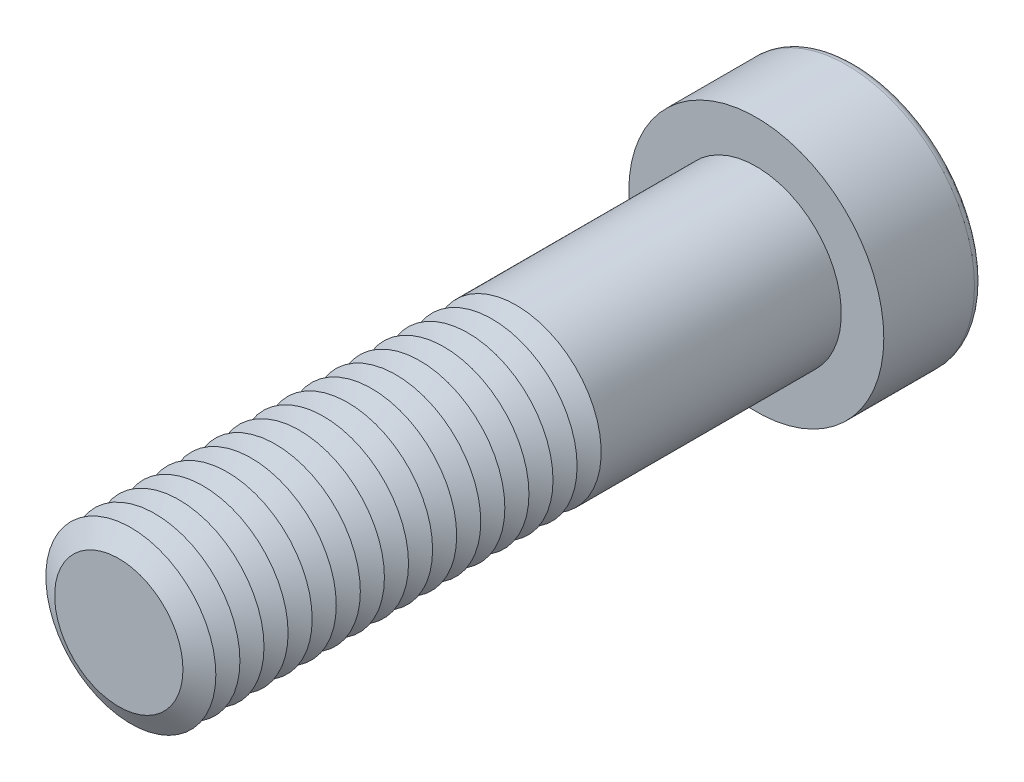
ISO-10303-21;
HEADER;
FILE_DESCRIPTION(('STEP AP214'),'2;1');
FILE_NAME('part.step','',(''),(''),'','','');
FILE_SCHEMA(('AUTOMOTIVE_DESIGN { 1 0 10303 214 1 1 1 1 }'));
ENDSEC;
DATA;
#1=APPLICATION_CONTEXT('core data for automotive mechanical design processes');
#2=APPLICATION_PROTOCOL_DEFINITION('international standard','automotive_design',2000,#1);
#3=PRODUCT_CONTEXT('',#1,'mechanical');
#4=PRODUCT('Part','Part','',(#3));
#5=PRODUCT_RELATED_PRODUCT_CATEGORY('part','',(#4));
#6=PRODUCT_DEFINITION_FORMATION('','',#4);
#7=PRODUCT_DEFINITION_CONTEXT('part definition',#1,'design');
#8=PRODUCT_DEFINITION('design','',#6,#7);
#9=PRODUCT_DEFINITION_SHAPE('','',#8);
#10=(LENGTH_UNIT() NAMED_UNIT(*) SI_UNIT(.MILLI.,.METRE.));
#11=(NAMED_UNIT(*) PLANE_ANGLE_UNIT() SI_UNIT($,.RADIAN.));
#12=(NAMED_UNIT(*) SI_UNIT($,.STERADIAN.) SOLID_ANGLE_UNIT());
#13=UNCERTAINTY_MEASURE_WITH_UNIT(LENGTH_MEASURE(1.E-05),#10,'distance_accuracy_value','');
#14=(GEOMETRIC_REPRESENTATION_CONTEXT(3) GLOBAL_UNCERTAINTY_ASSIGNED_CONTEXT((#13)) GLOBAL_UNIT_ASSIGNED_CONTEXT((#10,
#11,#12)) REPRESENTATION_CONTEXT('',''));
#15=CARTESIAN_POINT('',(0.,0.,0.));
#16=DIRECTION('',(0.,0.,1.));
#17=DIRECTION('',(1.,0.,0.));
#18=AXIS2_PLACEMENT_3D('',#15,#16,#17);
#19=CARTESIAN_POINT('',(0.,0.,39.05));
#20=DIRECTION('',(0.,0.,1.));
#21=DIRECTION('',(1.,0.,0.));
#22=AXIS2_PLACEMENT_3D('',#19,#20,#21);
#23=CONICAL_SURFACE('',#22,6.,1.0471975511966);
#24=CARTESIAN_POINT('',(0.,0.,38.2));
#25=DIRECTION('',(0.,0.,1.));
#26=DIRECTION('',(1.,0.,0.));
#27=AXIS2_PLACEMENT_3D('',#24,#25,#26);
#28=CIRCLE('',#27,4.52775681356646);
#29=CARTESIAN_POINT('',(4.52775681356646,0.,38.2));
#30=VERTEX_POINT('',#29);
#31=EDGE_CURVE('E312',#30,#30,#28,.T.);
#32=ORIENTED_EDGE('',*,*,#31,.T.);
#33=EDGE_LOOP('',(#32));
#34=FACE_BOUND('',#33,.T.);
#35=CARTESIAN_POINT('',(0.,0.,39.05));
#36=DIRECTION('',(0.,0.,1.));
#37=DIRECTION('',(1.,0.,0.));
#38=AXIS2_PLACEMENT_3D('',#35,#36,#37);
#39=CIRCLE('',#38,6.);
#40=CARTESIAN_POINT('',(6.,0.,39.05));
#41=VERTEX_POINT('',#40);
#42=EDGE_CURVE('E315',#41,#41,#39,.T.);
#43=ORIENTED_EDGE('',*,*,#42,.F.);
#44=EDGE_LOOP('',(#43));
#45=FACE_BOUND('',#44,.T.);
#46=ADVANCED_FACE('F39',(#34,#45),#23,.T.);
#47=CARTESIAN_POINT('',(0.,0.,38.2));
#48=DIRECTION('',(0.,0.,-1.));
#49=DIRECTION('',(-1.,0.,0.));
#50=AXIS2_PLACEMENT_3D('',#47,#48,#49);
#51=CONICAL_SURFACE('',#50,4.52775681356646,1.0471975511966);
#52=CARTESIAN_POINT('',(0.,0.,37.35));
#53=DIRECTION('',(0.,0.,1.));
#54=DIRECTION('',(1.,0.,0.));
#55=AXIS2_PLACEMENT_3D('',#52,#53,#54);
#56=CIRCLE('',#55,6.);
#57=CARTESIAN_POINT('',(6.,0.,37.35));
#58=VERTEX_POINT('',#57);
#59=EDGE_CURVE('E323',#58,#58,#56,.T.);
#60=ORIENTED_EDGE('',*,*,#59,.T.);
#61=EDGE_LOOP('',(#60));
#62=FACE_BOUND('',#61,.T.);
#63=ORIENTED_EDGE('',*,*,#31,.F.);
#64=EDGE_LOOP('',(#63));
#65=FACE_BOUND('',#64,.T.);
#66=ADVANCED_FACE('F244',(#62,#65),#51,.T.);
#67=CARTESIAN_POINT('',(0.,0.,45.));
#68=DIRECTION('',(0.,0.,1.));
#69=DIRECTION('',(1.,0.,0.));
#70=AXIS2_PLACEMENT_3D('',#67,#68,#69);
#71=PLANE('',#70);
#72=CARTESIAN_POINT('',(0.,0.,45.));
#73=DIRECTION('',(0.,0.,1.));
#74=DIRECTION('',(1.,0.,0.));
#75=AXIS2_PLACEMENT_3D('',#72,#73,#74);
#76=CIRCLE('',#75,4.52775681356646);
#77=CARTESIAN_POINT('',(4.52775681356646,0.,45.));
#78=VERTEX_POINT('',#77);
#79=EDGE_CURVE('E173',#78,#78,#76,.T.);
#80=ORIENTED_EDGE('',*,*,#79,.T.);
#81=EDGE_LOOP('',(#80));
#82=FACE_BOUND('',#81,.T.);
#83=ADVANCED_FACE('F250',(#82),#71,.T.);
#84=CARTESIAN_POINT('',(0.,0.,45.));
#85=DIRECTION('',(0.,0.,-1.));
#86=DIRECTION('',(-1.,0.,0.));
#87=AXIS2_PLACEMENT_3D('',#84,#85,#86);
#88=CONICAL_SURFACE('',#87,4.52775681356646,1.0471975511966);
#89=CARTESIAN_POINT('',(0.,0.,44.15));
#90=DIRECTION('',(0.,0.,1.));
#91=DIRECTION('',(1.,0.,0.));
#92=AXIS2_PLACEMENT_3D('',#89,#90,#91);
#93=CIRCLE('',#92,6.);
#94=CARTESIAN_POINT('',(6.,0.,44.15));
#95=VERTEX_POINT('',#94);
#96=EDGE_CURVE('E290',#95,#95,#93,.T.);
#97=ORIENTED_EDGE('',*,*,#96,.T.);
#98=EDGE_LOOP('',(#97));
#99=FACE_BOUND('',#98,.T.);
#100=ORIENTED_EDGE('',*,*,#79,.F.);
#101=EDGE_LOOP('',(#100));
#102=FACE_BOUND('',#101,.T.);
#103=ADVANCED_FACE('F198',(#99,#102),#88,.T.);
#104=CARTESIAN_POINT('',(0.,0.,44.15));
#105=DIRECTION('',(0.,0.,1.));
#106=DIRECTION('',(1.,0.,0.));
#107=AXIS2_PLACEMENT_3D('',#104,#105,#106);
#108=CONICAL_SURFACE('',#107,6.,1.0471975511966);
#109=CARTESIAN_POINT('',(0.,0.,43.3));
#110=DIRECTION('',(0.,0.,1.));
#111=DIRECTION('',(1.,0.,0.));
#112=AXIS2_PLACEMENT_3D('',#109,#110,#111);
#113=CIRCLE('',#112,4.52775681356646);
#114=CARTESIAN_POINT('',(4.52775681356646,0.,43.3));
#115=VERTEX_POINT('',#114);
#116=EDGE_CURVE('E287',#115,#115,#113,.T.);
#117=ORIENTED_EDGE('',*,*,#116,.T.);
#118=EDGE_LOOP('',(#117));
#119=FACE_BOUND('',#118,.T.);
#120=ORIENTED_EDGE('',*,*,#96,.F.);
#121=EDGE_LOOP('',(#120));
#122=FACE_BOUND('',#121,.T.);
#123=ADVANCED_FACE('F276',(#119,#122),#108,.T.);
#124=CARTESIAN_POINT('',(0.,0.,43.3));
#125=DIRECTION('',(0.,0.,-1.));
#126=DIRECTION('',(-1.,0.,0.));
#127=AXIS2_PLACEMENT_3D('',#124,#125,#126);
#128=CONICAL_SURFACE('',#127,4.52775681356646,1.0471975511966);
#129=CARTESIAN_POINT('',(0.,0.,42.45));
#130=DIRECTION('',(0.,0.,1.));
#131=DIRECTION('',(1.,0.,0.));
#132=AXIS2_PLACEMENT_3D('',#129,#130,#131);
#133=CIRCLE('',#132,6.);
#134=CARTESIAN_POINT('',(6.,0.,42.45));
#135=VERTEX_POINT('',#134);
#136=EDGE_CURVE('E299',#135,#135,#133,.T.);
#137=ORIENTED_EDGE('',*,*,#136,.T.);
#138=EDGE_LOOP('',(#137));
#139=FACE_BOUND('',#138,.T.);
#140=ORIENTED_EDGE('',*,*,#116,.F.);
#141=EDGE_LOOP('',(#140));
#142=FACE_BOUND('',#141,.T.);
#143=ADVANCED_FACE('F273',(#139,#142),#128,.T.);
#144=CARTESIAN_POINT('',(0.,0.,42.45));
#145=DIRECTION('',(0.,0.,1.));
#146=DIRECTION('',(1.,0.,0.));
#147=AXIS2_PLACEMENT_3D('',#144,#145,#146);
#148=CONICAL_SURFACE('',#147,6.,1.0471975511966);
#149=CARTESIAN_POINT('',(0.,0.,41.6));
#150=DIRECTION('',(0.,0.,1.));
#151=DIRECTION('',(1.,0.,0.));
#152=AXIS2_PLACEMENT_3D('',#149,#150,#151);
#153=CIRCLE('',#152,4.52775681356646);
#154=CARTESIAN_POINT('',(4.52775681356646,0.,41.6));
#155=VERTEX_POINT('',#154);
#156=EDGE_CURVE('E292',#155,#155,#153,.T.);
#157=ORIENTED_EDGE('',*,*,#156,.T.);
#158=EDGE_LOOP('',(#157));
#159=FACE_BOUND('',#158,.T.);
#160=ORIENTED_EDGE('',*,*,#136,.F.);
#161=EDGE_LOOP('',(#160));
#162=FACE_BOUND('',#161,.T.);
#163=ADVANCED_FACE('F269',(#159,#162),#148,.T.);
#164=CARTESIAN_POINT('',(0.,0.,41.6));
#165=DIRECTION('',(0.,0.,-1.));
#166=DIRECTION('',(-1.,0.,0.));
#167=AXIS2_PLACEMENT_3D('',#164,#165,#166);
#168=CONICAL_SURFACE('',#167,4.52775681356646,1.0471975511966);
#169=CARTESIAN_POINT('',(0.,0.,40.75));
#170=DIRECTION('',(0.,0.,1.));
#171=DIRECTION('',(1.,0.,0.));
#172=AXIS2_PLACEMENT_3D('',#169,#170,#171);
#173=CIRCLE('',#172,6.);
#174=CARTESIAN_POINT('',(6.,0.,40.75));
#175=VERTEX_POINT('',#174);
#176=EDGE_CURVE('E308',#175,#175,#173,.T.);
#177=ORIENTED_EDGE('',*,*,#176,.T.);
#178=EDGE_LOOP('',(#177));
#179=FACE_BOUND('',#178,.T.);
#180=ORIENTED_EDGE('',*,*,#156,.F.);
#181=EDGE_LOOP('',(#180));
#182=FACE_BOUND('',#181,.T.);
#183=ADVANCED_FACE('F265',(#179,#182),#168,.T.);
#184=CARTESIAN_POINT('',(0.,0.,40.75));
#185=DIRECTION('',(0.,0.,1.));
#186=DIRECTION('',(1.,0.,0.));
#187=AXIS2_PLACEMENT_3D('',#184,#185,#186);
#188=CONICAL_SURFACE('',#187,6.,1.0471975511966);
#189=CARTESIAN_POINT('',(0.,0.,39.9));
#190=DIRECTION('',(0.,0.,1.));
#191=DIRECTION('',(1.,0.,0.));
#192=AXIS2_PLACEMENT_3D('',#189,#190,#191);
#193=CIRCLE('',#192,4.52775681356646);
#194=CARTESIAN_POINT('',(4.52775681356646,0.,39.9));
#195=VERTEX_POINT('',#194);
#196=EDGE_CURVE('E305',#195,#195,#193,.T.);
#197=ORIENTED_EDGE('',*,*,#196,.T.);
#198=EDGE_LOOP('',(#197));
#199=FACE_BOUND('',#198,.T.);
#200=ORIENTED_EDGE('',*,*,#176,.F.);
#201=EDGE_LOOP('',(#200));
#202=FACE_BOUND('',#201,.T.);
#203=ADVANCED_FACE('F261',(#199,#202),#188,.T.);
#204=CARTESIAN_POINT('',(0.,0.,39.9));
#205=DIRECTION('',(0.,0.,-1.));
#206=DIRECTION('',(-1.,0.,0.));
#207=AXIS2_PLACEMENT_3D('',#204,#205,#206);
#208=CONICAL_SURFACE('',#207,4.52775681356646,1.0471975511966);
#209=ORIENTED_EDGE('',*,*,#42,.T.);
#210=EDGE_LOOP('',(#209));
#211=FACE_BOUND('',#210,.T.);
#212=ORIENTED_EDGE('',*,*,#196,.F.);
#213=EDGE_LOOP('',(#212));
#214=FACE_BOUND('',#213,.T.);
#215=ADVANCED_FACE('F257',(#211,#214),#208,.T.);
#216=CARTESIAN_POINT('',(0.,0.,37.35));
#217=DIRECTION('',(0.,0.,1.));
#218=DIRECTION('',(1.,0.,0.));
#219=AXIS2_PLACEMENT_3D('',#216,#217,#218);
#220=CONICAL_SURFACE('',#219,6.,1.0471975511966);
#221=CARTESIAN_POINT('',(0.,0.,36.5));
#222=DIRECTION('',(0.,0.,1.));
#223=DIRECTION('',(1.,0.,0.));
#224=AXIS2_PLACEMENT_3D('',#221,#222,#223);
#225=CIRCLE('',#224,4.52775681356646);
#226=CARTESIAN_POINT('',(4.52775681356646,0.,36.5));
#227=VERTEX_POINT('',#226);
#228=EDGE_CURVE('E319',#227,#227,#225,.T.);
#229=ORIENTED_EDGE('',*,*,#228,.T.);
#230=EDGE_LOOP('',(#229));
#231=FACE_BOUND('',#230,.T.);
#232=ORIENTED_EDGE('',*,*,#59,.F.);
#233=EDGE_LOOP('',(#232));
#234=FACE_BOUND('',#233,.T.);
#235=ADVANCED_FACE('F260',(#231,#234),#220,.T.);
#236=CARTESIAN_POINT('',(0.,0.,36.5));
#237=DIRECTION('',(0.,0.,-1.));
#238=DIRECTION('',(-1.,0.,0.));
#239=AXIS2_PLACEMENT_3D('',#236,#237,#238);
#240=CONICAL_SURFACE('',#239,4.52775681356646,1.0471975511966);
#241=CARTESIAN_POINT('',(0.,0.,35.65));
#242=DIRECTION('',(0.,0.,1.));
#243=DIRECTION('',(1.,0.,0.));
#244=AXIS2_PLACEMENT_3D('',#241,#242,#243);
#245=CIRCLE('',#244,6.);
#246=CARTESIAN_POINT('',(6.,0.,35.65));
#247=VERTEX_POINT('',#246);
#248=EDGE_CURVE('E331',#247,#247,#245,.T.);
#249=ORIENTED_EDGE('',*,*,#248,.T.);
#250=EDGE_LOOP('',(#249));
#251=FACE_BOUND('',#250,.T.);
#252=ORIENTED_EDGE('',*,*,#228,.F.);
#253=EDGE_LOOP('',(#252));
#254=FACE_BOUND('',#253,.T.);
#255=ADVANCED_FACE('F511',(#251,#254),#240,.T.);
#256=CARTESIAN_POINT('',(0.,0.,35.65));
#257=DIRECTION('',(0.,0.,1.));
#258=DIRECTION('',(1.,0.,0.));
#259=AXIS2_PLACEMENT_3D('',#256,#257,#258);
#260=CONICAL_SURFACE('',#259,6.,1.0471975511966);
#261=CARTESIAN_POINT('',(0.,0.,34.8));
#262=DIRECTION('',(0.,0.,1.));
#263=DIRECTION('',(1.,0.,0.));
#264=AXIS2_PLACEMENT_3D('',#261,#262,#263);
#265=CIRCLE('',#264,4.52775681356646);
#266=CARTESIAN_POINT('',(4.52775681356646,0.,34.8));
#267=VERTEX_POINT('',#266);
#268=EDGE_CURVE('E327',#267,#267,#265,.T.);
#269=ORIENTED_EDGE('',*,*,#268,.T.);
#270=EDGE_LOOP('',(#269));
#271=FACE_BOUND('',#270,.T.);
#272=ORIENTED_EDGE('',*,*,#248,.F.);
#273=EDGE_LOOP('',(#272));
#274=FACE_BOUND('',#273,.T.);
#275=ADVANCED_FACE('F507',(#271,#274),#260,.T.);
#276=CARTESIAN_POINT('',(0.,0.,34.8));
#277=DIRECTION('',(0.,0.,-1.));
#278=DIRECTION('',(-1.,0.,0.));
#279=AXIS2_PLACEMENT_3D('',#276,#277,#278);
#280=CONICAL_SURFACE('',#279,4.52775681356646,1.0471975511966);
#281=CARTESIAN_POINT('',(0.,0.,33.95));
#282=DIRECTION('',(0.,0.,1.));
#283=DIRECTION('',(1.,0.,0.));
#284=AXIS2_PLACEMENT_3D('',#281,#282,#283);
#285=CIRCLE('',#284,6.);
#286=CARTESIAN_POINT('',(6.,0.,33.95));
#287=VERTEX_POINT('',#286);
#288=EDGE_CURVE('E339',#287,#287,#285,.T.);
#289=ORIENTED_EDGE('',*,*,#288,.T.);
#290=EDGE_LOOP('',(#289));
#291=FACE_BOUND('',#290,.T.);
#292=ORIENTED_EDGE('',*,*,#268,.F.);
#293=EDGE_LOOP('',(#292));
#294=FACE_BOUND('',#293,.T.);
#295=ADVANCED_FACE('F503',(#291,#294),#280,.T.);
#296=CARTESIAN_POINT('',(0.,0.,33.95));
#297=DIRECTION('',(0.,0.,1.));
#298=DIRECTION('',(1.,0.,0.));
#299=AXIS2_PLACEMENT_3D('',#296,#297,#298);
#300=CONICAL_SURFACE('',#299,6.,1.0471975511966);
#301=CARTESIAN_POINT('',(0.,0.,33.1));
#302=DIRECTION('',(0.,0.,1.));
#303=DIRECTION('',(1.,0.,0.));
#304=AXIS2_PLACEMENT_3D('',#301,#302,#303);
#305=CIRCLE('',#304,4.52775681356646);
#306=CARTESIAN_POINT('',(4.52775681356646,0.,33.1));
#307=VERTEX_POINT('',#306);
#308=EDGE_CURVE('E335',#307,#307,#305,.T.);
#309=ORIENTED_EDGE('',*,*,#308,.T.);
#310=EDGE_LOOP('',(#309));
#311=FACE_BOUND('',#310,.T.);
#312=ORIENTED_EDGE('',*,*,#288,.F.);
#313=EDGE_LOOP('',(#312));
#314=FACE_BOUND('',#313,.T.);
#315=ADVANCED_FACE('F499',(#311,#314),#300,.T.);
#316=CARTESIAN_POINT('',(0.,0.,33.1));
#317=DIRECTION('',(0.,0.,-1.));
#318=DIRECTION('',(-1.,0.,0.));
#319=AXIS2_PLACEMENT_3D('',#316,#317,#318);
#320=CONICAL_SURFACE('',#319,4.52775681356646,1.0471975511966);
#321=CARTESIAN_POINT('',(0.,0.,32.25));
#322=DIRECTION('',(0.,0.,1.));
#323=DIRECTION('',(1.,0.,0.));
#324=AXIS2_PLACEMENT_3D('',#321,#322,#323);
#325=CIRCLE('',#324,6.);
#326=CARTESIAN_POINT('',(6.,0.,32.25));
#327=VERTEX_POINT('',#326);
#328=EDGE_CURVE('E347',#327,#327,#325,.T.);
#329=ORIENTED_EDGE('',*,*,#328,.T.);
#330=EDGE_LOOP('',(#329));
#331=FACE_BOUND('',#330,.T.);
#332=ORIENTED_EDGE('',*,*,#308,.F.);
#333=EDGE_LOOP('',(#332));
#334=FACE_BOUND('',#333,.T.);
#335=ADVANCED_FACE('F495',(#331,#334),#320,.T.);
#336=CARTESIAN_POINT('',(0.,0.,32.25));
#337=DIRECTION('',(0.,0.,1.));
#338=DIRECTION('',(1.,0.,0.));
#339=AXIS2_PLACEMENT_3D('',#336,#337,#338);
#340=CONICAL_SURFACE('',#339,6.,1.0471975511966);
#341=CARTESIAN_POINT('',(0.,0.,31.4));
#342=DIRECTION('',(0.,0.,1.));
#343=DIRECTION('',(1.,0.,0.));
#344=AXIS2_PLACEMENT_3D('',#341,#342,#343);
#345=CIRCLE('',#344,4.52775681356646);
#346=CARTESIAN_POINT('',(4.52775681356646,0.,31.4));
#347=VERTEX_POINT('',#346);
#348=EDGE_CURVE('E343',#347,#347,#345,.T.);
#349=ORIENTED_EDGE('',*,*,#348,.T.);
#350=EDGE_LOOP('',(#349));
#351=FACE_BOUND('',#350,.T.);
#352=ORIENTED_EDGE('',*,*,#328,.F.);
#353=EDGE_LOOP('',(#352));
#354=FACE_BOUND('',#353,.T.);
#355=ADVANCED_FACE('F491',(#351,#354),#340,.T.);
#356=CARTESIAN_POINT('',(0.,0.,31.4));
#357=DIRECTION('',(0.,0.,-1.));
#358=DIRECTION('',(-1.,0.,0.));
#359=AXIS2_PLACEMENT_3D('',#356,#357,#358);
#360=CONICAL_SURFACE('',#359,4.52775681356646,1.0471975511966);
#361=CARTESIAN_POINT('',(0.,0.,30.55));
#362=DIRECTION('',(0.,0.,1.));
#363=DIRECTION('',(1.,0.,0.));
#364=AXIS2_PLACEMENT_3D('',#361,#362,#363);
#365=CIRCLE('',#364,6.);
#366=CARTESIAN_POINT('',(6.,0.,30.55));
#367=VERTEX_POINT('',#366);
#368=EDGE_CURVE('E355',#367,#367,#365,.T.);
#369=ORIENTED_EDGE('',*,*,#368,.T.);
#370=EDGE_LOOP('',(#369));
#371=FACE_BOUND('',#370,.T.);
#372=ORIENTED_EDGE('',*,*,#348,.F.);
#373=EDGE_LOOP('',(#372));
#374=FACE_BOUND('',#373,.T.);
#375=ADVANCED_FACE('F487',(#371,#374),#360,.T.);
#376=CARTESIAN_POINT('',(0.,0.,30.55));
#377=DIRECTION('',(0.,0.,1.));
#378=DIRECTION('',(1.,0.,0.));
#379=AXIS2_PLACEMENT_3D('',#376,#377,#378);
#380=CONICAL_SURFACE('',#379,6.,1.0471975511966);
#381=CARTESIAN_POINT('',(0.,0.,29.7));
#382=DIRECTION('',(0.,0.,1.));
#383=DIRECTION('',(1.,0.,0.));
#384=AXIS2_PLACEMENT_3D('',#381,#382,#383);
#385=CIRCLE('',#384,4.52775681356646);
#386=CARTESIAN_POINT('',(4.52775681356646,0.,29.7));
#387=VERTEX_POINT('',#386);
#388=EDGE_CURVE('E351',#387,#387,#385,.T.);
#389=ORIENTED_EDGE('',*,*,#388,.T.);
#390=EDGE_LOOP('',(#389));
#391=FACE_BOUND('',#390,.T.);
#392=ORIENTED_EDGE('',*,*,#368,.F.);
#393=EDGE_LOOP('',(#392));
#394=FACE_BOUND('',#393,.T.);
#395=ADVANCED_FACE('F483',(#391,#394),#380,.T.);
#396=CARTESIAN_POINT('',(0.,0.,29.7));
#397=DIRECTION('',(0.,0.,-1.));
#398=DIRECTION('',(-1.,0.,0.));
#399=AXIS2_PLACEMENT_3D('',#396,#397,#398);
#400=CONICAL_SURFACE('',#399,4.52775681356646,1.0471975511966);
#401=CARTESIAN_POINT('',(0.,0.,28.85));
#402=DIRECTION('',(0.,0.,1.));
#403=DIRECTION('',(1.,0.,0.));
#404=AXIS2_PLACEMENT_3D('',#401,#402,#403);
#405=CIRCLE('',#404,6.);
#406=CARTESIAN_POINT('',(6.,0.,28.85));
#407=VERTEX_POINT('',#406);
#408=EDGE_CURVE('E363',#407,#407,#405,.T.);
#409=ORIENTED_EDGE('',*,*,#408,.T.);
#410=EDGE_LOOP('',(#409));
#411=FACE_BOUND('',#410,.T.);
#412=ORIENTED_EDGE('',*,*,#388,.F.);
#413=EDGE_LOOP('',(#412));
#414=FACE_BOUND('',#413,.T.);
#415=ADVANCED_FACE('F479',(#411,#414),#400,.T.);
#416=CARTESIAN_POINT('',(0.,0.,28.85));
#417=DIRECTION('',(0.,0.,1.));
#418=DIRECTION('',(1.,0.,0.));
#419=AXIS2_PLACEMENT_3D('',#416,#417,#418);
#420=CONICAL_SURFACE('',#419,6.,1.0471975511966);
#421=CARTESIAN_POINT('',(0.,0.,28.));
#422=DIRECTION('',(0.,0.,1.));
#423=DIRECTION('',(1.,0.,0.));
#424=AXIS2_PLACEMENT_3D('',#421,#422,#423);
#425=CIRCLE('',#424,4.52775681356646);
#426=CARTESIAN_POINT('',(4.52775681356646,0.,28.));
#427=VERTEX_POINT('',#426);
#428=EDGE_CURVE('E359',#427,#427,#425,.T.);
#429=ORIENTED_EDGE('',*,*,#428,.T.);
#430=EDGE_LOOP('',(#429));
#431=FACE_BOUND('',#430,.T.);
#432=ORIENTED_EDGE('',*,*,#408,.F.);
#433=EDGE_LOOP('',(#432));
#434=FACE_BOUND('',#433,.T.);
#435=ADVANCED_FACE('F475',(#431,#434),#420,.T.);
#436=CARTESIAN_POINT('',(0.,0.,28.));
#437=DIRECTION('',(0.,0.,-1.));
#438=DIRECTION('',(-1.,0.,0.));
#439=AXIS2_PLACEMENT_3D('',#436,#437,#438);
#440=CONICAL_SURFACE('',#439,4.52775681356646,1.0471975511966);
#441=CARTESIAN_POINT('',(0.,0.,27.15));
#442=DIRECTION('',(0.,0.,1.));
#443=DIRECTION('',(1.,0.,0.));
#444=AXIS2_PLACEMENT_3D('',#441,#442,#443);
#445=CIRCLE('',#444,6.);
#446=CARTESIAN_POINT('',(6.,0.,27.15));
#447=VERTEX_POINT('',#446);
#448=EDGE_CURVE('E371',#447,#447,#445,.T.);
#449=ORIENTED_EDGE('',*,*,#448,.T.);
#450=EDGE_LOOP('',(#449));
#451=FACE_BOUND('',#450,.T.);
#452=ORIENTED_EDGE('',*,*,#428,.F.);
#453=EDGE_LOOP('',(#452));
#454=FACE_BOUND('',#453,.T.);
#455=ADVANCED_FACE('F471',(#451,#454),#440,.T.);
#456=CARTESIAN_POINT('',(0.,0.,27.15));
#457=DIRECTION('',(0.,0.,1.));
#458=DIRECTION('',(1.,0.,0.));
#459=AXIS2_PLACEMENT_3D('',#456,#457,#458);
#460=CONICAL_SURFACE('',#459,6.,1.0471975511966);
#461=CARTESIAN_POINT('',(0.,0.,26.3));
#462=DIRECTION('',(0.,0.,1.));
#463=DIRECTION('',(1.,0.,0.));
#464=AXIS2_PLACEMENT_3D('',#461,#462,#463);
#465=CIRCLE('',#464,4.52775681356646);
#466=CARTESIAN_POINT('',(4.52775681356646,0.,26.3));
#467=VERTEX_POINT('',#466);
#468=EDGE_CURVE('E367',#467,#467,#465,.T.);
#469=ORIENTED_EDGE('',*,*,#468,.T.);
#470=EDGE_LOOP('',(#469));
#471=FACE_BOUND('',#470,.T.);
#472=ORIENTED_EDGE('',*,*,#448,.F.);
#473=EDGE_LOOP('',(#472));
#474=FACE_BOUND('',#473,.T.);
#475=ADVANCED_FACE('F467',(#471,#474),#460,.T.);
#476=CARTESIAN_POINT('',(0.,0.,26.3));
#477=DIRECTION('',(0.,0.,-1.));
#478=DIRECTION('',(-1.,0.,0.));
#479=AXIS2_PLACEMENT_3D('',#476,#477,#478);
#480=CONICAL_SURFACE('',#479,4.52775681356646,1.0471975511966);
#481=CARTESIAN_POINT('',(0.,0.,25.45));
#482=DIRECTION('',(0.,0.,1.));
#483=DIRECTION('',(1.,0.,0.));
#484=AXIS2_PLACEMENT_3D('',#481,#482,#483);
#485=CIRCLE('',#484,6.);
#486=CARTESIAN_POINT('',(6.,0.,25.45));
#487=VERTEX_POINT('',#486);
#488=EDGE_CURVE('E378',#487,#487,#485,.T.);
#489=ORIENTED_EDGE('',*,*,#488,.T.);
#490=EDGE_LOOP('',(#489));
#491=FACE_BOUND('',#490,.T.);
#492=ORIENTED_EDGE('',*,*,#468,.F.);
#493=EDGE_LOOP('',(#492));
#494=FACE_BOUND('',#493,.T.);
#495=ADVANCED_FACE('F463',(#491,#494),#480,.T.);
#496=CARTESIAN_POINT('',(0.,0.,25.45));
#497=DIRECTION('',(0.,0.,1.));
#498=DIRECTION('',(1.,0.,0.));
#499=AXIS2_PLACEMENT_3D('',#496,#497,#498);
#500=CONICAL_SURFACE('',#499,6.,1.0471975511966);
#501=CARTESIAN_POINT('',(0.,0.,24.6));
#502=DIRECTION('',(0.,0.,1.));
#503=DIRECTION('',(1.,0.,0.));
#504=AXIS2_PLACEMENT_3D('',#501,#502,#503);
#505=CIRCLE('',#504,4.52775681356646);
#506=CARTESIAN_POINT('',(4.52775681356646,0.,24.6));
#507=VERTEX_POINT('',#506);
#508=EDGE_CURVE('E375',#507,#507,#505,.T.);
#509=ORIENTED_EDGE('',*,*,#508,.T.);
#510=EDGE_LOOP('',(#509));
#511=FACE_BOUND('',#510,.T.);
#512=ORIENTED_EDGE('',*,*,#488,.F.);
#513=EDGE_LOOP('',(#512));
#514=FACE_BOUND('',#513,.T.);
#515=ADVANCED_FACE('F459',(#511,#514),#500,.T.);
#516=CARTESIAN_POINT('',(0.,0.,24.6));
#517=DIRECTION('',(0.,0.,-1.));
#518=DIRECTION('',(-1.,0.,0.));
#519=AXIS2_PLACEMENT_3D('',#516,#517,#518);
#520=CONICAL_SURFACE('',#519,4.52775681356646,1.0471975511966);
#521=CARTESIAN_POINT('',(0.,0.,23.75));
#522=DIRECTION('',(0.,0.,1.));
#523=DIRECTION('',(1.,0.,0.));
#524=AXIS2_PLACEMENT_3D('',#521,#522,#523);
#525=CIRCLE('',#524,6.);
#526=CARTESIAN_POINT('',(6.,0.,23.75));
#527=VERTEX_POINT('',#526);
#528=EDGE_CURVE('E386',#527,#527,#525,.T.);
#529=ORIENTED_EDGE('',*,*,#528,.T.);
#530=EDGE_LOOP('',(#529));
#531=FACE_BOUND('',#530,.T.);
#532=ORIENTED_EDGE('',*,*,#508,.F.);
#533=EDGE_LOOP('',(#532));
#534=FACE_BOUND('',#533,.T.);
#535=ADVANCED_FACE('F455',(#531,#534),#520,.T.);
#536=CARTESIAN_POINT('',(0.,0.,23.75));
#537=DIRECTION('',(0.,0.,1.));
#538=DIRECTION('',(1.,0.,0.));
#539=AXIS2_PLACEMENT_3D('',#536,#537,#538);
#540=CONICAL_SURFACE('',#539,6.,1.0471975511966);
#541=CARTESIAN_POINT('',(0.,0.,22.9));
#542=DIRECTION('',(0.,0.,1.));
#543=DIRECTION('',(1.,0.,0.));
#544=AXIS2_PLACEMENT_3D('',#541,#542,#543);
#545=CIRCLE('',#544,4.52775681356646);
#546=CARTESIAN_POINT('',(4.52775681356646,0.,22.9));
#547=VERTEX_POINT('',#546);
#548=EDGE_CURVE('E382',#547,#547,#545,.T.);
#549=ORIENTED_EDGE('',*,*,#548,.T.);
#550=EDGE_LOOP('',(#549));
#551=FACE_BOUND('',#550,.T.);
#552=ORIENTED_EDGE('',*,*,#528,.F.);
#553=EDGE_LOOP('',(#552));
#554=FACE_BOUND('',#553,.T.);
#555=ADVANCED_FACE('F451',(#551,#554),#540,.T.);
#556=CARTESIAN_POINT('',(0.,0.,22.9));
#557=DIRECTION('',(0.,0.,-1.));
#558=DIRECTION('',(-1.,0.,0.));
#559=AXIS2_PLACEMENT_3D('',#556,#557,#558);
#560=CONICAL_SURFACE('',#559,4.52775681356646,1.0471975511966);
#561=CARTESIAN_POINT('',(0.,0.,22.05));
#562=DIRECTION('',(0.,0.,1.));
#563=DIRECTION('',(1.,0.,0.));
#564=AXIS2_PLACEMENT_3D('',#561,#562,#563);
#565=CIRCLE('',#564,6.);
#566=CARTESIAN_POINT('',(6.,0.,22.05));
#567=VERTEX_POINT('',#566);
#568=EDGE_CURVE('E394',#567,#567,#565,.T.);
#569=ORIENTED_EDGE('',*,*,#568,.T.);
#570=EDGE_LOOP('',(#569));
#571=FACE_BOUND('',#570,.T.);
#572=ORIENTED_EDGE('',*,*,#548,.F.);
#573=EDGE_LOOP('',(#572));
#574=FACE_BOUND('',#573,.T.);
#575=ADVANCED_FACE('F447',(#571,#574),#560,.T.);
#576=CARTESIAN_POINT('',(0.,0.,22.05));
#577=DIRECTION('',(0.,0.,1.));
#578=DIRECTION('',(1.,0.,0.));
#579=AXIS2_PLACEMENT_3D('',#576,#577,#578);
#580=CONICAL_SURFACE('',#579,6.,1.0471975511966);
#581=CARTESIAN_POINT('',(0.,0.,21.2));
#582=DIRECTION('',(0.,0.,1.));
#583=DIRECTION('',(1.,0.,0.));
#584=AXIS2_PLACEMENT_3D('',#581,#582,#583);
#585=CIRCLE('',#584,4.52775681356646);
#586=CARTESIAN_POINT('',(4.52775681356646,0.,21.2));
#587=VERTEX_POINT('',#586);
#588=EDGE_CURVE('E390',#587,#587,#585,.T.);
#589=ORIENTED_EDGE('',*,*,#588,.T.);
#590=EDGE_LOOP('',(#589));
#591=FACE_BOUND('',#590,.T.);
#592=ORIENTED_EDGE('',*,*,#568,.F.);
#593=EDGE_LOOP('',(#592));
#594=FACE_BOUND('',#593,.T.);
#595=ADVANCED_FACE('F443',(#591,#594),#580,.T.);
#596=CARTESIAN_POINT('',(0.,0.,21.2));
#597=DIRECTION('',(0.,0.,-1.));
#598=DIRECTION('',(-1.,0.,0.));
#599=AXIS2_PLACEMENT_3D('',#596,#597,#598);
#600=CONICAL_SURFACE('',#599,4.52775681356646,1.0471975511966);
#601=CARTESIAN_POINT('',(0.,0.,20.35));
#602=DIRECTION('',(0.,0.,1.));
#603=DIRECTION('',(1.,0.,0.));
#604=AXIS2_PLACEMENT_3D('',#601,#602,#603);
#605=CIRCLE('',#604,6.);
#606=CARTESIAN_POINT('',(6.,0.,20.35));
#607=VERTEX_POINT('',#606);
#608=EDGE_CURVE('E402',#607,#607,#605,.T.);
#609=ORIENTED_EDGE('',*,*,#608,.T.);
#610=EDGE_LOOP('',(#609));
#611=FACE_BOUND('',#610,.T.);
#612=ORIENTED_EDGE('',*,*,#588,.F.);
#613=EDGE_LOOP('',(#612));
#614=FACE_BOUND('',#613,.T.);
#615=ADVANCED_FACE('F439',(#611,#614),#600,.T.);
#616=CARTESIAN_POINT('',(0.,0.,20.35));
#617=DIRECTION('',(0.,0.,1.));
#618=DIRECTION('',(1.,0.,0.));
#619=AXIS2_PLACEMENT_3D('',#616,#617,#618);
#620=CONICAL_SURFACE('',#619,6.,1.0471975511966);
#621=CARTESIAN_POINT('',(0.,0.,19.5));
#622=DIRECTION('',(0.,0.,1.));
#623=DIRECTION('',(1.,0.,0.));
#624=AXIS2_PLACEMENT_3D('',#621,#622,#623);
#625=CIRCLE('',#624,4.52775681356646);
#626=CARTESIAN_POINT('',(4.52775681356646,0.,19.5));
#627=VERTEX_POINT('',#626);
#628=EDGE_CURVE('E398',#627,#627,#625,.T.);
#629=ORIENTED_EDGE('',*,*,#628,.T.);
#630=EDGE_LOOP('',(#629));
#631=FACE_BOUND('',#630,.T.);
#632=ORIENTED_EDGE('',*,*,#608,.F.);
#633=EDGE_LOOP('',(#632));
#634=FACE_BOUND('',#633,.T.);
#635=ADVANCED_FACE('F434',(#631,#634),#620,.T.);
#636=CARTESIAN_POINT('',(0.,0.,19.5));
#637=DIRECTION('',(0.,0.,-1.));
#638=DIRECTION('',(-1.,0.,0.));
#639=AXIS2_PLACEMENT_3D('',#636,#637,#638);
#640=CONICAL_SURFACE('',#639,4.52775681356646,1.0471975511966);
#641=CARTESIAN_POINT('',(0.,0.,18.65));
#642=DIRECTION('',(0.,0.,1.));
#643=DIRECTION('',(1.,0.,0.));
#644=AXIS2_PLACEMENT_3D('',#641,#642,#643);
#645=CIRCLE('',#644,6.);
#646=CARTESIAN_POINT('',(6.,0.,18.65));
#647=VERTEX_POINT('',#646);
#648=EDGE_CURVE('E414',#647,#647,#645,.T.);
#649=ORIENTED_EDGE('',*,*,#648,.T.);
#650=EDGE_LOOP('',(#649));
#651=FACE_BOUND('',#650,.T.);
#652=ORIENTED_EDGE('',*,*,#628,.F.);
#653=EDGE_LOOP('',(#652));
#654=FACE_BOUND('',#653,.T.);
#655=ADVANCED_FACE('F420',(#651,#654),#640,.T.);
#656=CARTESIAN_POINT('',(0.,0.,18.65));
#657=DIRECTION('',(0.,0.,1.));
#658=DIRECTION('',(1.,0.,0.));
#659=AXIS2_PLACEMENT_3D('',#656,#657,#658);
#660=CONICAL_SURFACE('',#659,6.,1.0471975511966);
#661=CARTESIAN_POINT('',(0.,0.,17.8));
#662=DIRECTION('',(0.,0.,1.));
#663=DIRECTION('',(1.,0.,0.));
#664=AXIS2_PLACEMENT_3D('',#661,#662,#663);
#665=CIRCLE('',#664,4.52775681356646);
#666=CARTESIAN_POINT('',(4.52775681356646,0.,17.8));
#667=VERTEX_POINT('',#666);
#668=EDGE_CURVE('E406',#667,#667,#665,.T.);
#669=ORIENTED_EDGE('',*,*,#668,.T.);
#670=EDGE_LOOP('',(#669));
#671=FACE_BOUND('',#670,.T.);
#672=ORIENTED_EDGE('',*,*,#648,.F.);
#673=EDGE_LOOP('',(#672));
#674=FACE_BOUND('',#673,.T.);
#675=ADVANCED_FACE('F423',(#671,#674),#660,.T.);
#676=CARTESIAN_POINT('',(0.,0.,17.8));
#677=DIRECTION('',(0.,0.,-1.));
#678=DIRECTION('',(-1.,0.,0.));
#679=AXIS2_PLACEMENT_3D('',#676,#677,#678);
#680=CONICAL_SURFACE('',#679,4.52775681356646,1.0471975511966);
#681=CARTESIAN_POINT('',(0.,0.,16.95));
#682=DIRECTION('',(0.,0.,1.));
#683=DIRECTION('',(1.,0.,0.));
#684=AXIS2_PLACEMENT_3D('',#681,#682,#683);
#685=CIRCLE('',#684,6.);
#686=CARTESIAN_POINT('',(-6.,0.,16.95));
#687=VERTEX_POINT('',#686);
#688=EDGE_CURVE('E410',#687,#687,#685,.T.);
#689=ORIENTED_EDGE('',*,*,#688,.T.);
#690=EDGE_LOOP('',(#689));
#691=FACE_BOUND('',#690,.T.);
#692=ORIENTED_EDGE('',*,*,#668,.F.);
#693=EDGE_LOOP('',(#692));
#694=FACE_BOUND('',#693,.T.);
#695=ADVANCED_FACE('F425',(#691,#694),#680,.T.);
#696=CARTESIAN_POINT('',(0.,0.,-1.));
#697=DIRECTION('',(0.,0.,-1.));
#698=DIRECTION('',(-1.,0.,0.));
#699=AXIS2_PLACEMENT_3D('',#696,#697,#698);
#700=CONICAL_SURFACE('',#699,4.,1.0471975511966);
#701=CARTESIAN_POINT('',(0.,0.,1.30940107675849));
#702=VERTEX_POINT('',#701);
#703=VERTEX_LOOP('',#702);
#704=FACE_BOUND('',#703,.T.);
#705=CARTESIAN_POINT('',(0.,0.,-1.));
#706=DIRECTION('',(0.,0.,-1.));
#707=DIRECTION('',(-1.,0.,0.));
#708=AXIS2_PLACEMENT_3D('',#705,#706,#707);
#709=CIRCLE('',#708,4.);
#710=CARTESIAN_POINT('',(-3.46410161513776,2.,-1.));
#711=VERTEX_POINT('',#710);
#712=CARTESIAN_POINT('',(0.,4.,-1.));
#713=VERTEX_POINT('',#712);
#714=EDGE_CURVE('E149',#711,#713,#709,.T.);
#715=ORIENTED_EDGE('',*,*,#714,.T.);
#716=CARTESIAN_POINT('',(0.,0.,-1.));
#717=DIRECTION('',(0.,0.,-1.));
#718=DIRECTION('',(-1.,0.,0.));
#719=AXIS2_PLACEMENT_3D('',#716,#717,#718);
#720=CIRCLE('',#719,4.);
#721=CARTESIAN_POINT('',(3.46410161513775,2.,-1.));
#722=VERTEX_POINT('',#721);
#723=EDGE_CURVE('E54',#713,#722,#720,.T.);
#724=ORIENTED_EDGE('',*,*,#723,.T.);
#725=CARTESIAN_POINT('',(3.46410161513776,-2.,-1.));
#726=VERTEX_POINT('',#725);
#727=EDGE_CURVE('E1028',#722,#726,#720,.T.);
#728=ORIENTED_EDGE('',*,*,#727,.T.);
#729=CARTESIAN_POINT('',(0.,-4.,-1.));
#730=VERTEX_POINT('',#729);
#731=EDGE_CURVE('E1026',#726,#730,#720,.T.);
#732=ORIENTED_EDGE('',*,*,#731,.T.);
#733=CARTESIAN_POINT('',(-3.46410161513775,-2.,-1.));
#734=VERTEX_POINT('',#733);
#735=EDGE_CURVE('E1021',#730,#734,#720,.T.);
#736=ORIENTED_EDGE('',*,*,#735,.T.);
#737=EDGE_CURVE('E1019',#734,#711,#720,.T.);
#738=ORIENTED_EDGE('',*,*,#737,.T.);
#739=EDGE_LOOP('',(#715,#724,#728,#732,#736,#738));
#740=FACE_BOUND('',#739,.T.);
#741=ADVANCED_FACE('F200',(#704,#740),#700,.F.);
#742=CARTESIAN_POINT('',(0.,0.,-1.));
#743=DIRECTION('',(0.,0.,-1.));
#744=DIRECTION('',(-1.,0.,0.));
#745=AXIS2_PLACEMENT_3D('',#742,#743,#744);
#746=PLANE('',#745);
#747=ORIENTED_EDGE('',*,*,#723,.F.);
#748=DIRECTION('',(1.,0.,0.));
#749=VECTOR('',#748,1.);
#750=CARTESIAN_POINT('',(-2.3094010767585,4.,-1.));
#751=LINE('',#750,#749);
#752=CARTESIAN_POINT('',(2.3094010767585,4.,-1.));
#753=VERTEX_POINT('',#752);
#754=EDGE_CURVE('E1062',#713,#753,#751,.T.);
#755=ORIENTED_EDGE('',*,*,#754,.T.);
#756=DIRECTION('',(0.5,-0.866025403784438,0.));
#757=VECTOR('',#756,1.);
#758=CARTESIAN_POINT('',(2.3094010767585,4.,-1.));
#759=LINE('',#758,#757);
#760=EDGE_CURVE('E155',#753,#722,#759,.T.);
#761=ORIENTED_EDGE('',*,*,#760,.T.);
#762=EDGE_LOOP('',(#747,#755,#761));
#763=FACE_BOUND('',#762,.T.);
#764=ADVANCED_FACE('F606',(#763),#746,.T.);
#765=ORIENTED_EDGE('',*,*,#727,.F.);
#766=CARTESIAN_POINT('',(4.61880215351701,0.,-1.));
#767=VERTEX_POINT('',#766);
#768=EDGE_CURVE('E1066',#722,#767,#759,.T.);
#769=ORIENTED_EDGE('',*,*,#768,.T.);
#770=DIRECTION('',(-0.5,-0.866025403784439,0.));
#771=VECTOR('',#770,1.);
#772=CARTESIAN_POINT('',(4.61880215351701,0.,-1.));
#773=LINE('',#772,#771);
#774=EDGE_CURVE('E1040',#767,#726,#773,.T.);
#775=ORIENTED_EDGE('',*,*,#774,.T.);
#776=EDGE_LOOP('',(#765,#769,#775));
#777=FACE_BOUND('',#776,.T.);
#778=ADVANCED_FACE('F616',(#777),#746,.T.);
#779=ORIENTED_EDGE('',*,*,#731,.F.);
#780=CARTESIAN_POINT('',(2.3094010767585,-4.,-1.));
#781=VERTEX_POINT('',#780);
#782=EDGE_CURVE('E1042',#726,#781,#773,.T.);
#783=ORIENTED_EDGE('',*,*,#782,.T.);
#784=DIRECTION('',(-1.,0.,0.));
#785=VECTOR('',#784,1.);
#786=CARTESIAN_POINT('',(2.3094010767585,-4.,-1.));
#787=LINE('',#786,#785);
#788=EDGE_CURVE('E993',#781,#730,#787,.T.);
#789=ORIENTED_EDGE('',*,*,#788,.T.);
#790=EDGE_LOOP('',(#779,#783,#789));
#791=FACE_BOUND('',#790,.T.);
#792=ADVANCED_FACE('F626',(#791),#746,.T.);
#793=ORIENTED_EDGE('',*,*,#735,.F.);
#794=CARTESIAN_POINT('',(-2.3094010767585,-4.,-1.));
#795=VERTEX_POINT('',#794);
#796=EDGE_CURVE('E1036',#730,#795,#787,.T.);
#797=ORIENTED_EDGE('',*,*,#796,.T.);
#798=DIRECTION('',(-0.5,0.866025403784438,0.));
#799=VECTOR('',#798,1.);
#800=CARTESIAN_POINT('',(-2.3094010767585,-4.,-1.));
#801=LINE('',#800,#799);
#802=EDGE_CURVE('E1038',#795,#734,#801,.T.);
#803=ORIENTED_EDGE('',*,*,#802,.T.);
#804=EDGE_LOOP('',(#793,#797,#803));
#805=FACE_BOUND('',#804,.T.);
#806=ADVANCED_FACE('F634',(#805),#746,.T.);
#807=ORIENTED_EDGE('',*,*,#737,.F.);
#808=CARTESIAN_POINT('',(-4.61880215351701,0.,-1.));
#809=VERTEX_POINT('',#808);
#810=EDGE_CURVE('E1043',#734,#809,#801,.T.);
#811=ORIENTED_EDGE('',*,*,#810,.T.);
#812=DIRECTION('',(0.5,0.866025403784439,0.));
#813=VECTOR('',#812,1.);
#814=CARTESIAN_POINT('',(-4.61880215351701,0.,-1.));
#815=LINE('',#814,#813);
#816=EDGE_CURVE('E158',#809,#711,#815,.T.);
#817=ORIENTED_EDGE('',*,*,#816,.T.);
#818=EDGE_LOOP('',(#807,#811,#817));
#819=FACE_BOUND('',#818,.T.);
#820=ADVANCED_FACE('F230',(#819),#746,.T.);
#821=ORIENTED_EDGE('',*,*,#714,.F.);
#822=CARTESIAN_POINT('',(-2.3094010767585,4.,-1.));
#823=VERTEX_POINT('',#822);
#824=EDGE_CURVE('E1049',#711,#823,#815,.T.);
#825=ORIENTED_EDGE('',*,*,#824,.T.);
#826=EDGE_CURVE('E1063',#823,#713,#751,.T.);
#827=ORIENTED_EDGE('',*,*,#826,.T.);
#828=EDGE_LOOP('',(#821,#825,#827));
#829=FACE_BOUND('',#828,.T.);
#830=ADVANCED_FACE('F618',(#829),#746,.T.);
#831=CARTESIAN_POINT('',(-2.3094010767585,4.,-1.));
#832=DIRECTION('',(0.,1.,0.));
#833=DIRECTION('',(0.,0.,1.));
#834=AXIS2_PLACEMENT_3D('',#831,#832,#833);
#835=PLANE('',#834);
#836=DIRECTION('',(0.,0.,-1.));
#837=VECTOR('',#836,1.);
#838=CARTESIAN_POINT('',(-2.3094010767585,4.,-1.));
#839=LINE('',#838,#837);
#840=CARTESIAN_POINT('',(-2.3094010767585,4.,-7.));
#841=VERTEX_POINT('',#840);
#842=EDGE_CURVE('E147',#823,#841,#839,.T.);
#843=ORIENTED_EDGE('',*,*,#842,.T.);
#844=CARTESIAN_POINT('',(-6.02881516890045,4.,-7.70103379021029));
#845=CARTESIAN_POINT('',(-5.8481958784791,4.,-7.66071709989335));
#846=CARTESIAN_POINT('',(-5.66746141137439,4.,-7.62090727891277));
#847=CARTESIAN_POINT('',(-5.30570552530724,4.,-7.54257487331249));
#848=CARTESIAN_POINT('',(-5.12468409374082,4.,-7.50405234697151));
#849=CARTESIAN_POINT('',(-4.76212658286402,4.,-7.42853268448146));
#850=CARTESIAN_POINT('',(-4.58059016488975,4.,-7.39153716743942));
#851=CARTESIAN_POINT('',(-4.21713405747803,4.,-7.31948392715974));
#852=CARTESIAN_POINT('',(-4.03521437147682,4.,-7.28442618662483));
#853=CARTESIAN_POINT('',(-3.67250657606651,4.,-7.21700168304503));
#854=CARTESIAN_POINT('',(-3.4917223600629,4.,-7.18461419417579));
#855=CARTESIAN_POINT('',(-3.12965653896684,4.,-7.12275774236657));
#856=CARTESIAN_POINT('',(-2.94837492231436,4.,-7.09328884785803));
#857=CARTESIAN_POINT('',(-2.40374454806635,4.,-7.01026455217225));
#858=CARTESIAN_POINT('',(-2.03952090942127,4.,-6.96207428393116));
#859=CARTESIAN_POINT('',(-1.48950033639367,4.,-6.90518200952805));
#860=CARTESIAN_POINT('',(-1.30450135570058,4.,-6.88873552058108));
#861=CARTESIAN_POINT('',(-0.934053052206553,4.,-6.86198845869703));
#862=CARTESIAN_POINT('',(-0.748603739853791,4.,-6.85168774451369));
#863=CARTESIAN_POINT('',(-0.377528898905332,4.,-6.83783090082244));
#864=CARTESIAN_POINT('',(-0.191903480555,4.,-6.83427186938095));
#865=CARTESIAN_POINT('',(0.179350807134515,4.,-6.83411569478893));
#866=CARTESIAN_POINT('',(0.364979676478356,4.,-6.83751856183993));
#867=CARTESIAN_POINT('',(0.736742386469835,4.,-6.85109802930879));
#868=CARTESIAN_POINT('',(0.922875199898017,4.,-6.86130219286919));
#869=CARTESIAN_POINT('',(1.29469888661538,4.,-6.8879135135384));
#870=CARTESIAN_POINT('',(1.48038973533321,4.,-6.90432100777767));
#871=CARTESIAN_POINT('',(1.85132520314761,4.,-6.94252995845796));
#872=CARTESIAN_POINT('',(2.036569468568,4.,-6.96433479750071));
#873=CARTESIAN_POINT('',(2.40646407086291,4.,-7.0124559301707));
#874=CARTESIAN_POINT('',(2.59111440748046,4.,-7.03877222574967));
#875=CARTESIAN_POINT('',(2.96467049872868,4.,-7.09583231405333));
#876=CARTESIAN_POINT('',(3.15356118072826,4.,-7.12667393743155));
#877=CARTESIAN_POINT('',(3.53080577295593,4.,-7.19148953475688));
#878=CARTESIAN_POINT('',(3.71915966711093,4.,-7.22546360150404));
#879=CARTESIAN_POINT('',(4.2835627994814,4.,-7.33112271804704));
#880=CARTESIAN_POINT('',(4.65891157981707,4.,-7.40653797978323));
#881=CARTESIAN_POINT('',(5.40835351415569,4.,-7.56376983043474));
#882=CARTESIAN_POINT('',(5.78244627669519,4.,-7.64558825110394));
#883=CARTESIAN_POINT('',(6.52968076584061,4.,-7.81348272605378));
#884=CARTESIAN_POINT('',(6.90282246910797,4.,-7.89955888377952));
#885=CARTESIAN_POINT('',(7.64386653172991,4.,-8.07356157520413));
#886=CARTESIAN_POINT('',(8.01177724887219,4.,-8.16145269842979));
#887=CARTESIAN_POINT('',(8.74711499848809,4.,-8.33926751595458));
#888=CARTESIAN_POINT('',(9.11454201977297,4.,-8.42919125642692));
#889=CARTESIAN_POINT('',(9.84851788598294,4.,-8.61039317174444));
#890=CARTESIAN_POINT('',(10.2150672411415,4.,-8.70166928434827));
#891=CARTESIAN_POINT('',(10.9478692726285,4.,-8.88534974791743));
#892=CARTESIAN_POINT('',(11.3141219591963,4.,-8.97775405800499));
#893=CARTESIAN_POINT('',(11.6802738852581,4.,-9.07055157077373));
#894=B_SPLINE_CURVE_WITH_KNOTS('',3,(#844,#845,#846,#847,#848,#849,#850,#851,#852,#853,#854,
#855,#856,#857,#858,#859,#860,#861,#862,#863,#864,#865,#866,#867,#868,#869,#870,#871,#872,#873,
#874,#875,#876,#877,#878,#879,#880,#881,#882,#883,#884,#885,#886,#887,#888,#889,#890,#891,#892,
#893),.UNSPECIFIED.,.F.,.F.,(4,2,2,2,2,2,2,2,2,2,2,2,2,2,2,2,2,2,2,2,2,2,2,2,4),(0.,
0.555194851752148,1.11041480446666,1.6662090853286,2.22199840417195,2.77296094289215,
3.32393639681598,4.42561440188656,4.98271716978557,5.5398071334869,6.09665724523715,
6.65350817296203,7.2126296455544,7.77178150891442,8.33128469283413,8.89078811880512,
9.46493123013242,10.0390913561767,11.1875388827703,12.3363161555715,13.4851213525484,
14.6199040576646,15.7547125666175,16.8879395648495,18.0211256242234),.UNSPECIFIED.);
#895=CARTESIAN_POINT('',(2.3094010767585,4.,-7.));
#896=VERTEX_POINT('',#895);
#897=EDGE_CURVE('E124',#841,#896,#894,.T.);
#898=ORIENTED_EDGE('',*,*,#897,.T.);
#899=DIRECTION('',(0.,0.,-1.));
#900=VECTOR('',#899,1.);
#901=CARTESIAN_POINT('',(2.3094010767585,4.,-1.));
#902=LINE('',#901,#900);
#903=EDGE_CURVE('E143',#753,#896,#902,.T.);
#904=ORIENTED_EDGE('',*,*,#903,.F.);
#905=ORIENTED_EDGE('',*,*,#754,.F.);
#906=ORIENTED_EDGE('',*,*,#826,.F.);
#907=EDGE_LOOP('',(#843,#898,#904,#905,#906));
#908=FACE_BOUND('',#907,.T.);
#909=ADVANCED_FACE('F141',(#908),#835,.F.);
#910=CARTESIAN_POINT('',(2.3094010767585,4.,-1.));
#911=DIRECTION('',(0.866025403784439,0.5,0.));
#912=DIRECTION('',(-0.5,0.866025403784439,0.));
#913=AXIS2_PLACEMENT_3D('',#910,#911,#912);
#914=PLANE('',#913);
#915=ORIENTED_EDGE('',*,*,#903,.T.);
#916=CARTESIAN_POINT('',(2.30928560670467,4.0002,-7.0000309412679));
#917=CARTESIAN_POINT('',(2.40519879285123,3.83407348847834,-6.97431943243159));
#918=CARTESIAN_POINT('',(2.50128588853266,3.66764575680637,-6.95097756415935));
#919=CARTESIAN_POINT('',(2.69379944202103,3.33420250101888,-6.90996801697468));
#920=CARTESIAN_POINT('',(2.79022602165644,3.16718676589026,-6.89230264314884));
#921=CARTESIAN_POINT('',(2.98283386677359,2.83358019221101,-6.86367744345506));
#922=CARTESIAN_POINT('',(3.07901382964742,2.66699160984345,-6.85268347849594));
#923=CARTESIAN_POINT('',(3.27149641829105,2.33360198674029,-6.83794168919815));
#924=CARTESIAN_POINT('',(3.3677990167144,2.16680099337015,-6.83419246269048));
#925=CARTESIAN_POINT('',(3.56040421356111,1.83319900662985,-6.83419246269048));
#926=CARTESIAN_POINT('',(3.65670681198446,1.66639801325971,-6.83794168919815));
#927=CARTESIAN_POINT('',(3.84918940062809,1.33300839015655,-6.85268347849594));
#928=CARTESIAN_POINT('',(3.94536936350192,1.16641980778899,-6.86367744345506));
#929=CARTESIAN_POINT('',(4.13797720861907,0.832813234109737,-6.89230264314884));
#930=CARTESIAN_POINT('',(4.23440378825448,0.66579749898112,-6.90996801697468));
#931=CARTESIAN_POINT('',(4.42691734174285,0.332354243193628,-6.95097756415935));
#932=CARTESIAN_POINT('',(4.52300443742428,0.165926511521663,-6.97431943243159));
#933=CARTESIAN_POINT('',(4.61891762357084,-0.000199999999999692,-7.0000309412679));
#934=B_SPLINE_CURVE_WITH_KNOTS('',3,(#916,#917,#918,#919,#920,#921,#922,#923,#924,#925,#926,
#927,#928,#929,#930,#931,#932,#933),.UNSPECIFIED.,.F.,.F.,(4,2,2,2,2,2,2,2,4),(0.,
0.580655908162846,1.1615473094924,1.73944052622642,2.31722188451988,2.89500324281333,
3.47289645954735,4.0537878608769,4.63444376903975),.UNSPECIFIED.);
#935=CARTESIAN_POINT('',(4.61880215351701,0.,-7.));
#936=VERTEX_POINT('',#935);
#937=EDGE_CURVE('E11',#896,#936,#934,.T.);
#938=ORIENTED_EDGE('',*,*,#937,.T.);
#939=DIRECTION('',(0.,0.,-1.));
#940=VECTOR('',#939,1.);
#941=CARTESIAN_POINT('',(4.61880215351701,0.,-1.));
#942=LINE('',#941,#940);
#943=EDGE_CURVE('E157',#767,#936,#942,.T.);
#944=ORIENTED_EDGE('',*,*,#943,.F.);
#945=ORIENTED_EDGE('',*,*,#768,.F.);
#946=ORIENTED_EDGE('',*,*,#760,.F.);
#947=EDGE_LOOP('',(#915,#938,#944,#945,#946));
#948=FACE_BOUND('',#947,.T.);
#949=ADVANCED_FACE('F152',(#948),#914,.F.);
#950=CARTESIAN_POINT('',(4.61880215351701,0.,-1.));
#951=DIRECTION('',(0.866025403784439,-0.5,0.));
#952=DIRECTION('',(0.5,0.866025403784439,0.));
#953=AXIS2_PLACEMENT_3D('',#950,#951,#952);
#954=PLANE('',#953);
#955=ORIENTED_EDGE('',*,*,#943,.T.);
#956=CARTESIAN_POINT('',(4.61891762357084,0.00020000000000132,-7.0000309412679));
#957=CARTESIAN_POINT('',(4.52300443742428,-0.165926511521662,-6.97431943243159));
#958=CARTESIAN_POINT('',(4.42691734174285,-0.332354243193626,-6.95097756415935));
#959=CARTESIAN_POINT('',(4.23440378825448,-0.665797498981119,-6.90996801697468));
#960=CARTESIAN_POINT('',(4.13797720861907,-0.832813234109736,-6.89230264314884));
#961=CARTESIAN_POINT('',(3.94536936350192,-1.16641980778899,-6.86367744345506));
#962=CARTESIAN_POINT('',(3.84918940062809,-1.33300839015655,-6.85268347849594));
#963=CARTESIAN_POINT('',(3.65670681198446,-1.66639801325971,-6.83794168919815));
#964=CARTESIAN_POINT('',(3.56040421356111,-1.83319900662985,-6.83419246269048));
#965=CARTESIAN_POINT('',(3.3677990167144,-2.16680099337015,-6.83419246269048));
#966=CARTESIAN_POINT('',(3.27149641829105,-2.33360198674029,-6.83794168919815));
#967=CARTESIAN_POINT('',(3.07901382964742,-2.66699160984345,-6.85268347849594));
#968=CARTESIAN_POINT('',(2.98283386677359,-2.83358019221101,-6.86367744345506));
#969=CARTESIAN_POINT('',(2.79022602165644,-3.16718676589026,-6.89230264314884));
#970=CARTESIAN_POINT('',(2.69379944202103,-3.33420250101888,-6.90996801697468));
#971=CARTESIAN_POINT('',(2.50128588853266,-3.66764575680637,-6.95097756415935));
#972=CARTESIAN_POINT('',(2.40519879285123,-3.83407348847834,-6.97431943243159));
#973=CARTESIAN_POINT('',(2.30928560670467,-4.0002,-7.0000309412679));
#974=B_SPLINE_CURVE_WITH_KNOTS('',3,(#956,#957,#958,#959,#960,#961,#962,#963,#964,#965,#966,
#967,#968,#969,#970,#971,#972,#973),.UNSPECIFIED.,.F.,.F.,(4,2,2,2,2,2,2,2,4),(0.,
0.580655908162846,1.1615473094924,1.73944052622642,2.31722188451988,2.89500324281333,
3.47289645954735,4.0537878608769,4.63444376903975),.UNSPECIFIED.);
#975=CARTESIAN_POINT('',(2.3094010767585,-4.,-7.));
#976=VERTEX_POINT('',#975);
#977=EDGE_CURVE('E172',#936,#976,#974,.T.);
#978=ORIENTED_EDGE('',*,*,#977,.T.);
#979=DIRECTION('',(0.,0.,-1.));
#980=VECTOR('',#979,1.);
#981=CARTESIAN_POINT('',(2.3094010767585,-4.,-1.));
#982=LINE('',#981,#980);
#983=EDGE_CURVE('E988',#781,#976,#982,.T.);
#984=ORIENTED_EDGE('',*,*,#983,.F.);
#985=ORIENTED_EDGE('',*,*,#782,.F.);
#986=ORIENTED_EDGE('',*,*,#774,.F.);
#987=EDGE_LOOP('',(#955,#978,#984,#985,#986));
#988=FACE_BOUND('',#987,.T.);
#989=ADVANCED_FACE('F190',(#988),#954,.F.);
#990=CARTESIAN_POINT('',(2.3094010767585,-4.,-1.));
#991=DIRECTION('',(0.,-1.,0.));
#992=DIRECTION('',(0.,0.,-1.));
#993=AXIS2_PLACEMENT_3D('',#990,#991,#992);
#994=PLANE('',#993);
#995=ORIENTED_EDGE('',*,*,#983,.T.);
#996=CARTESIAN_POINT('',(-6.02881516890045,-4.,-7.70103379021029));
#997=CARTESIAN_POINT('',(-5.8481958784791,-4.,-7.66071709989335));
#998=CARTESIAN_POINT('',(-5.66746141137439,-4.,-7.62090727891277));
#999=CARTESIAN_POINT('',(-5.30570552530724,-4.,-7.54257487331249));
#1000=CARTESIAN_POINT('',(-5.12468409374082,-4.,-7.50405234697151));
#1001=CARTESIAN_POINT('',(-4.76212658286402,-4.,-7.42853268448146));
#1002=CARTESIAN_POINT('',(-4.58059016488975,-4.,-7.39153716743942));
#1003=CARTESIAN_POINT('',(-4.21713405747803,-4.,-7.31948392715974));
#1004=CARTESIAN_POINT('',(-4.03521437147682,-4.,-7.28442618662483));
#1005=CARTESIAN_POINT('',(-3.67250657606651,-4.,-7.21700168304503));
#1006=CARTESIAN_POINT('',(-3.49172236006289,-4.,-7.18461419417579));
#1007=CARTESIAN_POINT('',(-3.12965653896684,-4.,-7.12275774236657));
#1008=CARTESIAN_POINT('',(-2.94837492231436,-4.,-7.09328884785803));
#1009=CARTESIAN_POINT('',(-2.40374454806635,-4.,-7.01026455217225));
#1010=CARTESIAN_POINT('',(-2.03952090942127,-4.,-6.96207428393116));
#1011=CARTESIAN_POINT('',(-1.48950033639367,-4.,-6.90518200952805));
#1012=CARTESIAN_POINT('',(-1.30450135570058,-4.,-6.88873552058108));
#1013=CARTESIAN_POINT('',(-0.934053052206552,-4.,-6.86198845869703));
#1014=CARTESIAN_POINT('',(-0.748603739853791,-4.,-6.85168774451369));
#1015=CARTESIAN_POINT('',(-0.377528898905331,-4.,-6.83783090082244));
#1016=CARTESIAN_POINT('',(-0.191903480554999,-4.,-6.83427186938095));
#1017=CARTESIAN_POINT('',(0.179350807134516,-4.,-6.83411569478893));
#1018=CARTESIAN_POINT('',(0.364979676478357,-4.,-6.83751856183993));
#1019=CARTESIAN_POINT('',(0.736742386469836,-4.,-6.85109802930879));
#1020=CARTESIAN_POINT('',(0.922875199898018,-4.,-6.86130219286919));
#1021=CARTESIAN_POINT('',(1.29469888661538,-4.,-6.8879135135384));
#1022=CARTESIAN_POINT('',(1.48038973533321,-4.,-6.90432100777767));
#1023=CARTESIAN_POINT('',(1.85132520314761,-4.,-6.94252995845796));
#1024=CARTESIAN_POINT('',(2.036569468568,-4.,-6.96433479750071));
#1025=CARTESIAN_POINT('',(2.40646407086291,-4.,-7.0124559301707));
#1026=CARTESIAN_POINT('',(2.59111440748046,-4.,-7.03877222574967));
#1027=CARTESIAN_POINT('',(2.96467049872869,-4.,-7.09583231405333));
#1028=CARTESIAN_POINT('',(3.15356118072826,-4.,-7.12667393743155));
#1029=CARTESIAN_POINT('',(3.53080577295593,-4.,-7.19148953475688));
#1030=CARTESIAN_POINT('',(3.71915966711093,-4.,-7.22546360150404));
#1031=CARTESIAN_POINT('',(4.2835627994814,-4.,-7.33112271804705));
#1032=CARTESIAN_POINT('',(4.65891157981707,-4.,-7.40653797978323));
#1033=CARTESIAN_POINT('',(5.40835351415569,-4.,-7.56376983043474));
#1034=CARTESIAN_POINT('',(5.78244627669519,-4.,-7.64558825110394));
#1035=CARTESIAN_POINT('',(6.52968076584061,-4.,-7.81348272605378));
#1036=CARTESIAN_POINT('',(6.90282246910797,-4.,-7.89955888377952));
#1037=CARTESIAN_POINT('',(7.64386653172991,-4.,-8.07356157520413));
#1038=CARTESIAN_POINT('',(8.01177724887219,-4.,-8.16145269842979));
#1039=CARTESIAN_POINT('',(8.74711499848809,-4.,-8.33926751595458));
#1040=CARTESIAN_POINT('',(9.11454201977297,-4.,-8.42919125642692));
#1041=CARTESIAN_POINT('',(9.84851788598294,-4.,-8.61039317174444));
#1042=CARTESIAN_POINT('',(10.2150672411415,-4.,-8.70166928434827));
#1043=CARTESIAN_POINT('',(10.9478692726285,-4.,-8.88534974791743));
#1044=CARTESIAN_POINT('',(11.3141219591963,-4.,-8.97775405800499));
#1045=CARTESIAN_POINT('',(11.6802738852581,-4.,-9.07055157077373));
#1046=B_SPLINE_CURVE_WITH_KNOTS('',3,(#996,#997,#998,#999,#1000,#1001,#1002,#1003,#1004,#1005,
#1006,#1007,#1008,#1009,#1010,#1011,#1012,#1013,#1014,#1015,#1016,#1017,#1018,#1019,#1020,#1021,
#1022,#1023,#1024,#1025,#1026,#1027,#1028,#1029,#1030,#1031,#1032,#1033,#1034,#1035,#1036,#1037,
#1038,#1039,#1040,#1041,#1042,#1043,#1044,#1045),.UNSPECIFIED.,.F.,.F.,(4,2,2,2,2,2,2,2,2,2,2,2,
2,2,2,2,2,2,2,2,2,2,2,2,4),(0.,0.555194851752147,1.11041480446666,1.6662090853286,
2.22199840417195,2.77296094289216,3.32393639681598,4.42561440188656,4.98271716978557,
5.5398071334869,6.09665724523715,6.65350817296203,7.2126296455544,7.77178150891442,
8.33128469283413,8.89078811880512,9.46493123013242,10.0390913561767,11.1875388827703,
12.3363161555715,13.4851213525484,14.6199040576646,15.7547125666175,16.8879395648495,
18.0211256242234),.UNSPECIFIED.);
#1047=CARTESIAN_POINT('',(-2.3094010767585,-4.,-7.));
#1048=VERTEX_POINT('',#1047);
#1049=EDGE_CURVE('E183',#976,#1048,#1046,.F.);
#1050=ORIENTED_EDGE('',*,*,#1049,.T.);
#1051=DIRECTION('',(0.,0.,-1.));
#1052=VECTOR('',#1051,1.);
#1053=CARTESIAN_POINT('',(-2.3094010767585,-4.,-1.));
#1054=LINE('',#1053,#1052);
#1055=EDGE_CURVE('E994',#795,#1048,#1054,.T.);
#1056=ORIENTED_EDGE('',*,*,#1055,.F.);
#1057=ORIENTED_EDGE('',*,*,#796,.F.);
#1058=ORIENTED_EDGE('',*,*,#788,.F.);
#1059=EDGE_LOOP('',(#995,#1050,#1056,#1057,#1058));
#1060=FACE_BOUND('',#1059,.T.);
#1061=ADVANCED_FACE('F233',(#1060),#994,.F.);
#1062=CARTESIAN_POINT('',(-2.3094010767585,-4.,-1.));
#1063=DIRECTION('',(-0.866025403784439,-0.5,0.));
#1064=DIRECTION('',(0.5,-0.866025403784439,0.));
#1065=AXIS2_PLACEMENT_3D('',#1062,#1063,#1064);
#1066=PLANE('',#1065);
#1067=ORIENTED_EDGE('',*,*,#1055,.T.);
#1068=CARTESIAN_POINT('',(-2.30928560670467,-4.0002,-7.0000309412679));
#1069=CARTESIAN_POINT('',(-2.40519879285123,-3.83407348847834,-6.97431943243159));
#1070=CARTESIAN_POINT('',(-2.50128588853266,-3.66764575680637,-6.95097756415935));
#1071=CARTESIAN_POINT('',(-2.69379944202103,-3.33420250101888,-6.90996801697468));
#1072=CARTESIAN_POINT('',(-2.79022602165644,-3.16718676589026,-6.89230264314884));
#1073=CARTESIAN_POINT('',(-2.98283386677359,-2.83358019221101,-6.86367744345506));
#1074=CARTESIAN_POINT('',(-3.07901382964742,-2.66699160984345,-6.85268347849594));
#1075=CARTESIAN_POINT('',(-3.27149641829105,-2.33360198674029,-6.83794168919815));
#1076=CARTESIAN_POINT('',(-3.3677990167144,-2.16680099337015,-6.83419246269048));
#1077=CARTESIAN_POINT('',(-3.56040421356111,-1.83319900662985,-6.83419246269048));
#1078=CARTESIAN_POINT('',(-3.65670681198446,-1.66639801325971,-6.83794168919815));
#1079=CARTESIAN_POINT('',(-3.84918940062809,-1.33300839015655,-6.85268347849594));
#1080=CARTESIAN_POINT('',(-3.94536936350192,-1.16641980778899,-6.86367744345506));
#1081=CARTESIAN_POINT('',(-4.13797720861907,-0.832813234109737,-6.89230264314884));
#1082=CARTESIAN_POINT('',(-4.23440378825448,-0.66579749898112,-6.90996801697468));
#1083=CARTESIAN_POINT('',(-4.42691734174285,-0.332354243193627,-6.95097756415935));
#1084=CARTESIAN_POINT('',(-4.52300443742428,-0.165926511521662,-6.97431943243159));
#1085=CARTESIAN_POINT('',(-4.61891762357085,0.000200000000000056,-7.0000309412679));
#1086=B_SPLINE_CURVE_WITH_KNOTS('',3,(#1068,#1069,#1070,#1071,#1072,#1073,#1074,#1075,#1076,
#1077,#1078,#1079,#1080,#1081,#1082,#1083,#1084,#1085),.UNSPECIFIED.,.F.,.F.,(4,2,2,2,2,2,2,2,
4),(0.,0.580655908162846,1.1615473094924,1.73944052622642,2.31722188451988,2.89500324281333,
3.47289645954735,4.05378786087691,4.63444376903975),.UNSPECIFIED.);
#1087=CARTESIAN_POINT('',(-4.61880215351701,0.,-7.));
#1088=VERTEX_POINT('',#1087);
#1089=EDGE_CURVE('E207',#1048,#1088,#1086,.T.);
#1090=ORIENTED_EDGE('',*,*,#1089,.T.);
#1091=DIRECTION('',(0.,0.,-1.));
#1092=VECTOR('',#1091,1.);
#1093=CARTESIAN_POINT('',(-4.61880215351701,0.,-1.));
#1094=LINE('',#1093,#1092);
#1095=EDGE_CURVE('E998',#809,#1088,#1094,.T.);
#1096=ORIENTED_EDGE('',*,*,#1095,.F.);
#1097=ORIENTED_EDGE('',*,*,#810,.F.);
#1098=ORIENTED_EDGE('',*,*,#802,.F.);
#1099=EDGE_LOOP('',(#1067,#1090,#1096,#1097,#1098));
#1100=FACE_BOUND('',#1099,.T.);
#1101=ADVANCED_FACE('F228',(#1100),#1066,.F.);
#1102=CARTESIAN_POINT('',(-4.61880215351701,0.,-1.));
#1103=DIRECTION('',(-0.866025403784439,0.5,0.));
#1104=DIRECTION('',(-0.5,-0.866025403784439,0.));
#1105=AXIS2_PLACEMENT_3D('',#1102,#1103,#1104);
#1106=PLANE('',#1105);
#1107=ORIENTED_EDGE('',*,*,#1095,.T.);
#1108=CARTESIAN_POINT('',(-4.61891762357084,-0.000200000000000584,-7.0000309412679));
#1109=CARTESIAN_POINT('',(-4.52300443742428,0.165926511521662,-6.97431943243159));
#1110=CARTESIAN_POINT('',(-4.42691734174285,0.332354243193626,-6.95097756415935));
#1111=CARTESIAN_POINT('',(-4.23440378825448,0.66579749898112,-6.90996801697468));
#1112=CARTESIAN_POINT('',(-4.13797720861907,0.832813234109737,-6.89230264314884));
#1113=CARTESIAN_POINT('',(-3.94536936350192,1.16641980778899,-6.86367744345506));
#1114=CARTESIAN_POINT('',(-3.84918940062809,1.33300839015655,-6.85268347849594));
#1115=CARTESIAN_POINT('',(-3.65670681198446,1.66639801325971,-6.83794168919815));
#1116=CARTESIAN_POINT('',(-3.56040421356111,1.83319900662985,-6.83419246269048));
#1117=CARTESIAN_POINT('',(-3.3677990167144,2.16680099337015,-6.83419246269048));
#1118=CARTESIAN_POINT('',(-3.27149641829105,2.33360198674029,-6.83794168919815));
#1119=CARTESIAN_POINT('',(-3.07901382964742,2.66699160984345,-6.85268347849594));
#1120=CARTESIAN_POINT('',(-2.98283386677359,2.83358019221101,-6.86367744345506));
#1121=CARTESIAN_POINT('',(-2.79022602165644,3.16718676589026,-6.89230264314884));
#1122=CARTESIAN_POINT('',(-2.69379944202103,3.33420250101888,-6.90996801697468));
#1123=CARTESIAN_POINT('',(-2.50128588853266,3.66764575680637,-6.95097756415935));
#1124=CARTESIAN_POINT('',(-2.40519879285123,3.83407348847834,-6.97431943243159));
#1125=CARTESIAN_POINT('',(-2.30928560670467,4.0002,-7.0000309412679));
#1126=B_SPLINE_CURVE_WITH_KNOTS('',3,(#1108,#1109,#1110,#1111,#1112,#1113,#1114,#1115,#1116,
#1117,#1118,#1119,#1120,#1121,#1122,#1123,#1124,#1125),.UNSPECIFIED.,.F.,.F.,(4,2,2,2,2,2,2,2,
4),(0.,0.580655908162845,1.1615473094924,1.73944052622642,2.31722188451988,2.89500324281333,
3.47289645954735,4.05378786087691,4.63444376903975),.UNSPECIFIED.);
#1127=EDGE_CURVE('E150',#1088,#841,#1126,.T.);
#1128=ORIENTED_EDGE('',*,*,#1127,.T.);
#1129=ORIENTED_EDGE('',*,*,#842,.F.);
#1130=ORIENTED_EDGE('',*,*,#824,.F.);
#1131=ORIENTED_EDGE('',*,*,#816,.F.);
#1132=EDGE_LOOP('',(#1107,#1128,#1129,#1130,#1131));
#1133=FACE_BOUND('',#1132,.T.);
#1134=ADVANCED_FACE('F196',(#1133),#1106,.F.);
#1135=CARTESIAN_POINT('',(0.,0.,-7.));
#1136=DIRECTION('',(0.,0.,-1.));
#1137=DIRECTION('',(-1.,0.,0.));
#1138=AXIS2_PLACEMENT_3D('',#1135,#1136,#1137);
#1139=CONICAL_SURFACE('',#1138,4.61880215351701,1.30899693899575);
#1140=CARTESIAN_POINT('',(0.,0.,-7.));
#1141=DIRECTION('',(0.,0.,-1.));
#1142=DIRECTION('',(-1.,0.,0.));
#1143=AXIS2_PLACEMENT_3D('',#1140,#1141,#1142);
#1144=CIRCLE('',#1143,4.61880215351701);
#1145=EDGE_CURVE('E120',#841,#896,#1144,.T.);
#1146=ORIENTED_EDGE('',*,*,#1145,.T.);
#1147=ORIENTED_EDGE('',*,*,#897,.F.);
#1148=EDGE_LOOP('',(#1146,#1147));
#1149=FACE_BOUND('',#1148,.T.);
#1150=ADVANCED_FACE('F122',(#1149),#1139,.F.);
#1151=EDGE_CURVE('E129',#896,#936,#1144,.T.);
#1152=ORIENTED_EDGE('',*,*,#1151,.T.);
#1153=ORIENTED_EDGE('',*,*,#937,.F.);
#1154=EDGE_LOOP('',(#1152,#1153));
#1155=FACE_BOUND('',#1154,.T.);
#1156=ADVANCED_FACE('F133',(#1155),#1139,.F.);
#1157=EDGE_CURVE('E164',#936,#976,#1144,.T.);
#1158=ORIENTED_EDGE('',*,*,#1157,.T.);
#1159=ORIENTED_EDGE('',*,*,#977,.F.);
#1160=EDGE_LOOP('',(#1158,#1159));
#1161=FACE_BOUND('',#1160,.T.);
#1162=ADVANCED_FACE('F699',(#1161),#1139,.F.);
#1163=EDGE_CURVE('E168',#976,#1048,#1144,.T.);
#1164=ORIENTED_EDGE('',*,*,#1163,.T.);
#1165=ORIENTED_EDGE('',*,*,#1049,.F.);
#1166=EDGE_LOOP('',(#1164,#1165));
#1167=FACE_BOUND('',#1166,.T.);
#1168=ADVANCED_FACE('F706',(#1167),#1139,.F.);
#1169=EDGE_CURVE('E67',#1048,#1088,#1144,.T.);
#1170=ORIENTED_EDGE('',*,*,#1169,.T.);
#1171=ORIENTED_EDGE('',*,*,#1089,.F.);
#1172=EDGE_LOOP('',(#1170,#1171));
#1173=FACE_BOUND('',#1172,.T.);
#1174=ADVANCED_FACE('F714',(#1173),#1139,.F.);
#1175=EDGE_CURVE('E60',#1088,#841,#1144,.T.);
#1176=ORIENTED_EDGE('',*,*,#1175,.T.);
#1177=ORIENTED_EDGE('',*,*,#1127,.F.);
#1178=EDGE_LOOP('',(#1176,#1177));
#1179=FACE_BOUND('',#1178,.T.);
#1180=ADVANCED_FACE('F197',(#1179),#1139,.F.);
#1181=CARTESIAN_POINT('',(0.,0.,-7.));
#1182=DIRECTION('',(0.,0.,-1.));
#1183=DIRECTION('',(-1.,0.,0.));
#1184=AXIS2_PLACEMENT_3D('',#1181,#1182,#1183);
#1185=PLANE('',#1184);
#1186=ORIENTED_EDGE('',*,*,#1175,.F.);
#1187=ORIENTED_EDGE('',*,*,#1169,.F.);
#1188=ORIENTED_EDGE('',*,*,#1163,.F.);
#1189=ORIENTED_EDGE('',*,*,#1157,.F.);
#1190=ORIENTED_EDGE('',*,*,#1151,.F.);
#1191=ORIENTED_EDGE('',*,*,#1145,.F.);
#1192=EDGE_LOOP('',(#1186,#1187,#1188,#1189,#1190,#1191));
#1193=FACE_BOUND('',#1192,.T.);
#1194=CARTESIAN_POINT('',(0.,0.,-7.));
#1195=DIRECTION('',(0.,0.,-1.));
#1196=DIRECTION('',(-1.,0.,0.));
#1197=AXIS2_PLACEMENT_3D('',#1194,#1195,#1196);
#1198=CIRCLE('',#1197,8.4);
#1199=CARTESIAN_POINT('',(-8.4,0.,-7.));
#1200=VERTEX_POINT('',#1199);
#1201=EDGE_CURVE('E1012',#1200,#1200,#1198,.T.);
#1202=ORIENTED_EDGE('',*,*,#1201,.T.);
#1203=EDGE_LOOP('',(#1202));
#1204=FACE_BOUND('',#1203,.T.);
#1205=ADVANCED_FACE('F161',(#1193,#1204),#1185,.T.);
#1206=CARTESIAN_POINT('',(0.,0.,-6.4));
#1207=DIRECTION('',(0.,0.,-1.));
#1208=DIRECTION('',(-1.,0.,0.));
#1209=AXIS2_PLACEMENT_3D('',#1206,#1207,#1208);
#1210=TOROIDAL_SURFACE('',#1209,8.4,0.6);
#1211=CARTESIAN_POINT('',(0.,0.,-6.4));
#1212=DIRECTION('',(0.,0.,-1.));
#1213=DIRECTION('',(-1.,0.,0.));
#1214=AXIS2_PLACEMENT_3D('',#1211,#1212,#1213);
#1215=CIRCLE('',#1214,9.);
#1216=CARTESIAN_POINT('',(-9.,0.,-6.4));
#1217=VERTEX_POINT('',#1216);
#1218=EDGE_CURVE('E1016',#1217,#1217,#1215,.F.);
#1219=ORIENTED_EDGE('',*,*,#1218,.F.);
#1220=EDGE_LOOP('',(#1219));
#1221=FACE_BOUND('',#1220,.T.);
#1222=ORIENTED_EDGE('',*,*,#1201,.F.);
#1223=EDGE_LOOP('',(#1222));
#1224=FACE_BOUND('',#1223,.T.);
#1225=ADVANCED_FACE('F41',(#1221,#1224),#1210,.T.);
#1226=CARTESIAN_POINT('',(0.,0.,-7.));
#1227=DIRECTION('',(0.,0.,1.));
#1228=DIRECTION('',(1.,0.,0.));
#1229=AXIS2_PLACEMENT_3D('',#1226,#1227,#1228);
#1230=CYLINDRICAL_SURFACE('',#1229,9.);
#1231=ORIENTED_EDGE('',*,*,#1218,.T.);
#1232=EDGE_LOOP('',(#1231));
#1233=FACE_BOUND('',#1232,.T.);
#1234=CARTESIAN_POINT('',(0.,0.,0.));
#1235=DIRECTION('',(0.,0.,-1.));
#1236=DIRECTION('',(-1.,0.,0.));
#1237=AXIS2_PLACEMENT_3D('',#1234,#1235,#1236);
#1238=CIRCLE('',#1237,9.);
#1239=CARTESIAN_POINT('',(-9.,0.,0.));
#1240=VERTEX_POINT('',#1239);
#1241=EDGE_CURVE('E1004',#1240,#1240,#1238,.T.);
#1242=ORIENTED_EDGE('',*,*,#1241,.T.);
#1243=EDGE_LOOP('',(#1242));
#1244=FACE_BOUND('',#1243,.T.);
#1245=ADVANCED_FACE('F738',(#1233,#1244),#1230,.T.);
#1246=CARTESIAN_POINT('',(0.,0.,0.));
#1247=DIRECTION('',(0.,0.,-1.));
#1248=DIRECTION('',(-1.,0.,0.));
#1249=AXIS2_PLACEMENT_3D('',#1246,#1247,#1248);
#1250=PLANE('',#1249);
#1251=CARTESIAN_POINT('',(0.,0.,0.));
#1252=DIRECTION('',(0.,0.,1.));
#1253=DIRECTION('',(1.,0.,0.));
#1254=AXIS2_PLACEMENT_3D('',#1251,#1252,#1253);
#1255=CIRCLE('',#1254,6.);
#1256=CARTESIAN_POINT('',(-6.,0.,0.));
#1257=VERTEX_POINT('',#1256);
#1258=EDGE_CURVE('E1008',#1257,#1257,#1255,.T.);
#1259=ORIENTED_EDGE('',*,*,#1258,.F.);
#1260=EDGE_LOOP('',(#1259));
#1261=FACE_BOUND('',#1260,.T.);
#1262=ORIENTED_EDGE('',*,*,#1241,.F.);
#1263=EDGE_LOOP('',(#1262));
#1264=FACE_BOUND('',#1263,.T.);
#1265=ADVANCED_FACE('F746',(#1261,#1264),#1250,.F.);
#1266=CARTESIAN_POINT('',(0.,0.,45.));
#1267=DIRECTION('',(0.,0.,-1.));
#1268=DIRECTION('',(-1.,0.,0.));
#1269=AXIS2_PLACEMENT_3D('',#1266,#1267,#1268);
#1270=CYLINDRICAL_SURFACE('',#1269,6.);
#1271=CARTESIAN_POINT('',(-6.,0.,0.));
#1272=CARTESIAN_POINT('',(-6.,0.,0.176562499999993));
#1273=CARTESIAN_POINT('',(-6.,0.,0.353124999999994));
#1274=CARTESIAN_POINT('',(-6.,0.,0.706249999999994));
#1275=CARTESIAN_POINT('',(-6.,0.,0.882812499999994));
#1276=CARTESIAN_POINT('',(-6.,0.,1.23593749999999));
#1277=CARTESIAN_POINT('',(-6.,0.,1.41249999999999));
#1278=CARTESIAN_POINT('',(-6.,0.,1.765625));
#1279=CARTESIAN_POINT('',(-6.,0.,1.9421875));
#1280=CARTESIAN_POINT('',(-6.,0.,2.2953125));
#1281=CARTESIAN_POINT('',(-6.,0.,2.471875));
#1282=CARTESIAN_POINT('',(-6.,0.,2.825));
#1283=CARTESIAN_POINT('',(-6.,0.,3.0015625));
#1284=CARTESIAN_POINT('',(-6.,0.,3.3546875));
#1285=CARTESIAN_POINT('',(-6.,0.,3.53125));
#1286=CARTESIAN_POINT('',(-6.,0.,3.884375));
#1287=CARTESIAN_POINT('',(-6.,0.,4.0609375));
#1288=CARTESIAN_POINT('',(-6.,0.,4.4140625));
#1289=CARTESIAN_POINT('',(-6.,0.,4.590625));
#1290=CARTESIAN_POINT('',(-6.,0.,4.94375));
#1291=CARTESIAN_POINT('',(-6.,0.,5.1203125));
#1292=CARTESIAN_POINT('',(-6.,0.,5.4734375));
#1293=CARTESIAN_POINT('',(-6.,0.,5.65));
#1294=CARTESIAN_POINT('',(-6.,0.,6.003125));
#1295=CARTESIAN_POINT('',(-6.,0.,6.1796875));
#1296=CARTESIAN_POINT('',(-6.,0.,6.5328125));
#1297=CARTESIAN_POINT('',(-6.,0.,6.709375));
#1298=CARTESIAN_POINT('',(-6.,0.,7.0625));
#1299=CARTESIAN_POINT('',(-6.,0.,7.2390625));
#1300=CARTESIAN_POINT('',(-6.,0.,7.5921875));
#1301=CARTESIAN_POINT('',(-6.,0.,7.76875));
#1302=CARTESIAN_POINT('',(-6.,0.,8.121875));
#1303=CARTESIAN_POINT('',(-6.,0.,8.2984375));
#1304=CARTESIAN_POINT('',(-6.,0.,8.6515625));
#1305=CARTESIAN_POINT('',(-6.,0.,8.828125));
#1306=CARTESIAN_POINT('',(-6.,0.,9.18125));
#1307=CARTESIAN_POINT('',(-6.,0.,9.3578125));
#1308=CARTESIAN_POINT('',(-6.,0.,9.7109375));
#1309=CARTESIAN_POINT('',(-6.,0.,9.88750000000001));
#1310=CARTESIAN_POINT('',(-6.,0.,10.240625));
#1311=CARTESIAN_POINT('',(-6.,0.,10.4171875));
#1312=CARTESIAN_POINT('',(-6.,0.,10.7703125));
#1313=CARTESIAN_POINT('',(-6.,0.,10.946875));
#1314=CARTESIAN_POINT('',(-6.,0.,11.3));
#1315=CARTESIAN_POINT('',(-6.,0.,11.4765625));
#1316=CARTESIAN_POINT('',(-6.,0.,11.8296875));
#1317=CARTESIAN_POINT('',(-6.,0.,12.00625));
#1318=CARTESIAN_POINT('',(-6.,0.,12.359375));
#1319=CARTESIAN_POINT('',(-6.,0.,12.5359375));
#1320=CARTESIAN_POINT('',(-6.,0.,12.8890625));
#1321=CARTESIAN_POINT('',(-6.,0.,13.065625));
#1322=CARTESIAN_POINT('',(-6.,0.,13.41875));
#1323=CARTESIAN_POINT('',(-6.,0.,13.5953125));
#1324=CARTESIAN_POINT('',(-6.,0.,13.9484375));
#1325=CARTESIAN_POINT('',(-6.,0.,14.125));
#1326=CARTESIAN_POINT('',(-6.,0.,14.478125));
#1327=CARTESIAN_POINT('',(-6.,0.,14.6546875));
#1328=CARTESIAN_POINT('',(-6.,0.,15.0078125));
#1329=CARTESIAN_POINT('',(-6.,0.,15.184375));
#1330=CARTESIAN_POINT('',(-6.,0.,15.5375));
#1331=CARTESIAN_POINT('',(-6.,0.,15.7140625));
#1332=CARTESIAN_POINT('',(-6.,0.,16.0671875));
#1333=CARTESIAN_POINT('',(-6.,0.,16.24375));
#1334=CARTESIAN_POINT('',(-6.,0.,16.596875));
#1335=CARTESIAN_POINT('',(-6.,0.,16.7734375));
#1336=CARTESIAN_POINT('',(-6.,0.,16.95));
#1337=B_SPLINE_CURVE_WITH_KNOTS('',3,(#1271,#1272,#1273,#1274,#1275,#1276,#1277,#1278,#1279,
#1280,#1281,#1282,#1283,#1284,#1285,#1286,#1287,#1288,#1289,#1290,#1291,#1292,#1293,#1294,#1295,
#1296,#1297,#1298,#1299,#1300,#1301,#1302,#1303,#1304,#1305,#1306,#1307,#1308,#1309,#1310,#1311,
#1312,#1313,#1314,#1315,#1316,#1317,#1318,#1319,#1320,#1321,#1322,#1323,#1324,#1325,#1326,#1327,
#1328,#1329,#1330,#1331,#1332,#1333,#1334,#1335,#1336),.UNSPECIFIED.,.F.,.F.,(4,2,2,2,2,2,2,2,2,
2,2,2,2,2,2,2,2,2,2,2,2,2,2,2,2,2,2,2,2,2,2,2,4),(0.,0.529687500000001,1.059375,1.5890625,
2.11875,2.6484375,3.178125,3.7078125,4.23750000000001,4.76718750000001,5.29687500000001,
5.82656250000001,6.35625000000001,6.88593750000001,7.41562500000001,7.94531250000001,
8.47500000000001,9.00468750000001,9.53437500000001,10.0640625,10.59375,11.1234375,11.653125,
12.1828125,12.7125,13.2421875,13.771875,14.3015625,14.83125,15.3609375,15.890625,16.4203125,
16.95),.UNSPECIFIED.);
#1338=EDGE_CURVE('BSEAM755',#1257,#687,#1337,.T.);
#1339=ORIENTED_EDGE('',*,*,#1258,.T.);
#1340=ORIENTED_EDGE('',*,*,#688,.F.);
#1341=ORIENTED_EDGE('',*,*,#1338,.T.);
#1342=ORIENTED_EDGE('',*,*,#1338,.F.);
#1343=EDGE_LOOP('',(#1339,#1341,#1340,#1342));
#1344=FACE_BOUND('',#1343,.T.);
#1345=ADVANCED_FACE('F755',(#1344),#1270,.T.);
#1346=CLOSED_SHELL('',(#46,#66,#83,#103,#123,#143,#163,#183,#203,#215,#235,#255,#275,#295,#315,
#335,#355,#375,#395,#415,#435,#455,#475,#495,#515,#535,#555,#575,#595,#615,#635,#655,#675,#695,
#741,#764,#778,#792,#806,#820,#830,#909,#949,#989,#1061,#1101,#1134,#1150,#1156,#1162,#1168,
#1174,#1180,#1205,#1225,#1245,#1265,#1345));
#1347=MANIFOLD_SOLID_BREP('B2',#1346);
#1348=ADVANCED_BREP_SHAPE_REPRESENTATION('',(#18,#1347),#14);
#1349=SHAPE_DEFINITION_REPRESENTATION(#9,#1348);
ENDSEC;
END-ISO-10303-21;
